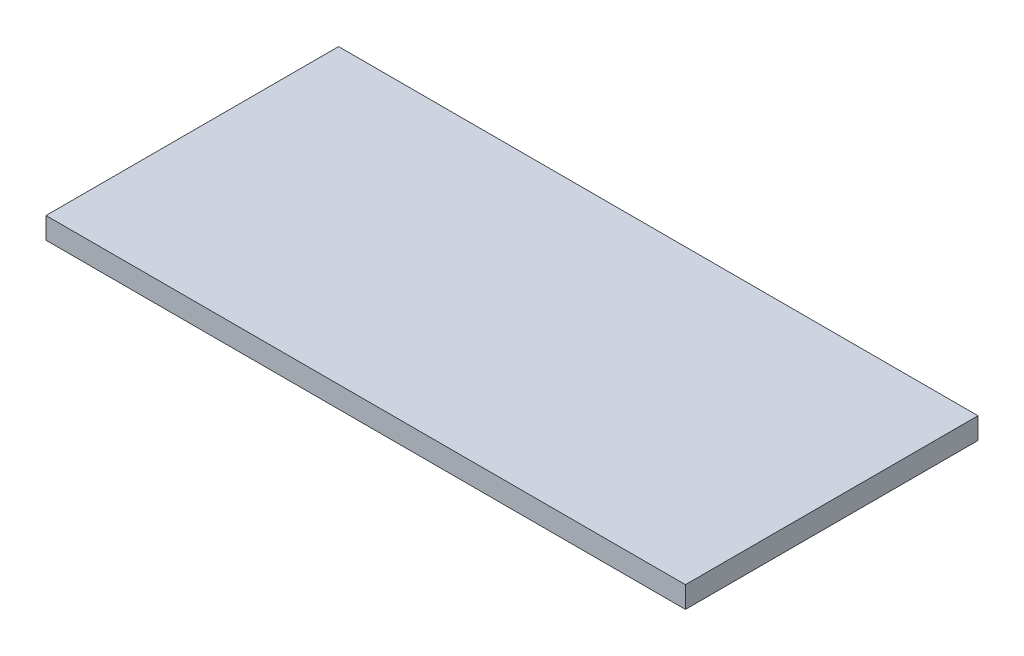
ISO-10303-21;
HEADER;
FILE_DESCRIPTION(('STEP AP214'),'2;1');
FILE_NAME('part.step','',(''),(''),'','','');
FILE_SCHEMA(('AUTOMOTIVE_DESIGN { 1 0 10303 214 1 1 1 1 }'));
ENDSEC;
DATA;
#1=APPLICATION_CONTEXT('core data for automotive mechanical design processes');
#2=APPLICATION_PROTOCOL_DEFINITION('international standard','automotive_design',2000,#1);
#3=PRODUCT_CONTEXT('',#1,'mechanical');
#4=PRODUCT('Part','Part','',(#3));
#5=PRODUCT_RELATED_PRODUCT_CATEGORY('part','',(#4));
#6=PRODUCT_DEFINITION_FORMATION('','',#4);
#7=PRODUCT_DEFINITION_CONTEXT('part definition',#1,'design');
#8=PRODUCT_DEFINITION('design','',#6,#7);
#9=PRODUCT_DEFINITION_SHAPE('','',#8);
#10=(LENGTH_UNIT() NAMED_UNIT(*) SI_UNIT(.MILLI.,.METRE.));
#11=(NAMED_UNIT(*) PLANE_ANGLE_UNIT() SI_UNIT($,.RADIAN.));
#12=(NAMED_UNIT(*) SI_UNIT($,.STERADIAN.) SOLID_ANGLE_UNIT());
#13=UNCERTAINTY_MEASURE_WITH_UNIT(LENGTH_MEASURE(1.E-05),#10,'distance_accuracy_value','');
#14=(GEOMETRIC_REPRESENTATION_CONTEXT(3) GLOBAL_UNCERTAINTY_ASSIGNED_CONTEXT((#13)) GLOBAL_UNIT_ASSIGNED_CONTEXT((#10,
#11,#12)) REPRESENTATION_CONTEXT('',''));
#15=CARTESIAN_POINT('',(0.,0.,0.));
#16=DIRECTION('',(0.,0.,1.));
#17=DIRECTION('',(1.,0.,0.));
#18=AXIS2_PLACEMENT_3D('',#15,#16,#17);
#19=CARTESIAN_POINT('',(152.,5.1,-69.55));
#20=DIRECTION('',(-1.,0.,0.));
#21=DIRECTION('',(0.,0.,1.));
#22=AXIS2_PLACEMENT_3D('',#19,#20,#21);
#23=PLANE('',#22);
#24=DIRECTION('',(0.,0.,-1.));
#25=VECTOR('',#24,1.);
#26=CARTESIAN_POINT('',(152.,-5.1,-69.55));
#27=LINE('',#26,#25);
#28=CARTESIAN_POINT('',(152.,-5.1,69.55));
#29=VERTEX_POINT('',#28);
#30=CARTESIAN_POINT('',(152.,-5.1,-69.55));
#31=VERTEX_POINT('',#30);
#32=EDGE_CURVE('E95',#29,#31,#27,.T.);
#33=ORIENTED_EDGE('',*,*,#32,.T.);
#34=DIRECTION('',(0.,-1.,0.));
#35=VECTOR('',#34,1.);
#36=CARTESIAN_POINT('',(152.,5.1,-69.55));
#37=LINE('',#36,#35);
#38=CARTESIAN_POINT('',(152.,5.1,-69.55));
#39=VERTEX_POINT('',#38);
#40=EDGE_CURVE('E11',#39,#31,#37,.T.);
#41=ORIENTED_EDGE('',*,*,#40,.F.);
#42=DIRECTION('',(0.,0.,-1.));
#43=VECTOR('',#42,1.);
#44=CARTESIAN_POINT('',(152.,5.1,-69.55));
#45=LINE('',#44,#43);
#46=CARTESIAN_POINT('',(152.,5.1,69.55));
#47=VERTEX_POINT('',#46);
#48=EDGE_CURVE('E83',#47,#39,#45,.T.);
#49=ORIENTED_EDGE('',*,*,#48,.F.);
#50=DIRECTION('',(0.,-1.,0.));
#51=VECTOR('',#50,1.);
#52=CARTESIAN_POINT('',(152.,5.1,69.55));
#53=LINE('',#52,#51);
#54=EDGE_CURVE('E91',#47,#29,#53,.T.);
#55=ORIENTED_EDGE('',*,*,#54,.T.);
#56=EDGE_LOOP('',(#33,#41,#49,#55));
#57=FACE_BOUND('',#56,.T.);
#58=ADVANCED_FACE('F32',(#57),#23,.F.);
#59=CARTESIAN_POINT('',(-152.,5.1,-69.55));
#60=DIRECTION('',(0.,0.,1.));
#61=DIRECTION('',(1.,0.,0.));
#62=AXIS2_PLACEMENT_3D('',#59,#60,#61);
#63=PLANE('',#62);
#64=DIRECTION('',(-1.,0.,0.));
#65=VECTOR('',#64,1.);
#66=CARTESIAN_POINT('',(-152.,-5.1,-69.55));
#67=LINE('',#66,#65);
#68=CARTESIAN_POINT('',(-152.,-5.1,-69.55));
#69=VERTEX_POINT('',#68);
#70=EDGE_CURVE('E87',#31,#69,#67,.T.);
#71=ORIENTED_EDGE('',*,*,#70,.T.);
#72=DIRECTION('',(0.,-1.,0.));
#73=VECTOR('',#72,1.);
#74=CARTESIAN_POINT('',(-152.,5.1,-69.55));
#75=LINE('',#74,#73);
#76=CARTESIAN_POINT('',(-152.,5.1,-69.55));
#77=VERTEX_POINT('',#76);
#78=EDGE_CURVE('E40',#77,#69,#75,.T.);
#79=ORIENTED_EDGE('',*,*,#78,.F.);
#80=DIRECTION('',(-1.,0.,0.));
#81=VECTOR('',#80,1.);
#82=CARTESIAN_POINT('',(-152.,5.1,-69.55));
#83=LINE('',#82,#81);
#84=EDGE_CURVE('E78',#39,#77,#83,.T.);
#85=ORIENTED_EDGE('',*,*,#84,.F.);
#86=ORIENTED_EDGE('',*,*,#40,.T.);
#87=EDGE_LOOP('',(#71,#79,#85,#86));
#88=FACE_BOUND('',#87,.T.);
#89=ADVANCED_FACE('F86',(#88),#63,.F.);
#90=CARTESIAN_POINT('',(-152.,5.1,-69.55));
#91=DIRECTION('',(1.,0.,0.));
#92=DIRECTION('',(0.,0.,-1.));
#93=AXIS2_PLACEMENT_3D('',#90,#91,#92);
#94=PLANE('',#93);
#95=DIRECTION('',(0.,0.,1.));
#96=VECTOR('',#95,1.);
#97=CARTESIAN_POINT('',(-152.,-5.1,-69.55));
#98=LINE('',#97,#96);
#99=CARTESIAN_POINT('',(-152.,-5.1,69.55));
#100=VERTEX_POINT('',#99);
#101=EDGE_CURVE('E65',#69,#100,#98,.T.);
#102=ORIENTED_EDGE('',*,*,#101,.T.);
#103=DIRECTION('',(0.,-1.,0.));
#104=VECTOR('',#103,1.);
#105=CARTESIAN_POINT('',(-152.,5.1,69.55));
#106=LINE('',#105,#104);
#107=CARTESIAN_POINT('',(-152.,5.1,69.55));
#108=VERTEX_POINT('',#107);
#109=EDGE_CURVE('E88',#108,#100,#106,.T.);
#110=ORIENTED_EDGE('',*,*,#109,.F.);
#111=DIRECTION('',(0.,0.,1.));
#112=VECTOR('',#111,1.);
#113=CARTESIAN_POINT('',(-152.,5.1,-69.55));
#114=LINE('',#113,#112);
#115=EDGE_CURVE('E81',#77,#108,#114,.T.);
#116=ORIENTED_EDGE('',*,*,#115,.F.);
#117=ORIENTED_EDGE('',*,*,#78,.T.);
#118=EDGE_LOOP('',(#102,#110,#116,#117));
#119=FACE_BOUND('',#118,.T.);
#120=ADVANCED_FACE('F89',(#119),#94,.F.);
#121=CARTESIAN_POINT('',(-152.,5.1,69.55));
#122=DIRECTION('',(0.,0.,-1.));
#123=DIRECTION('',(-1.,0.,0.));
#124=AXIS2_PLACEMENT_3D('',#121,#122,#123);
#125=PLANE('',#124);
#126=DIRECTION('',(1.,0.,0.));
#127=VECTOR('',#126,1.);
#128=CARTESIAN_POINT('',(-152.,-5.1,69.55));
#129=LINE('',#128,#127);
#130=EDGE_CURVE('E71',#100,#29,#129,.T.);
#131=ORIENTED_EDGE('',*,*,#130,.T.);
#132=ORIENTED_EDGE('',*,*,#54,.F.);
#133=DIRECTION('',(1.,0.,0.));
#134=VECTOR('',#133,1.);
#135=CARTESIAN_POINT('',(-152.,5.1,69.55));
#136=LINE('',#135,#134);
#137=EDGE_CURVE('E48',#108,#47,#136,.T.);
#138=ORIENTED_EDGE('',*,*,#137,.F.);
#139=ORIENTED_EDGE('',*,*,#109,.T.);
#140=EDGE_LOOP('',(#131,#132,#138,#139));
#141=FACE_BOUND('',#140,.T.);
#142=ADVANCED_FACE('F102',(#141),#125,.F.);
#143=CARTESIAN_POINT('',(0.,5.1,0.));
#144=DIRECTION('',(0.,1.,0.));
#145=DIRECTION('',(0.,0.,1.));
#146=AXIS2_PLACEMENT_3D('',#143,#144,#145);
#147=PLANE('',#146);
#148=ORIENTED_EDGE('',*,*,#48,.T.);
#149=ORIENTED_EDGE('',*,*,#84,.T.);
#150=ORIENTED_EDGE('',*,*,#115,.T.);
#151=ORIENTED_EDGE('',*,*,#137,.T.);
#152=EDGE_LOOP('',(#148,#149,#150,#151));
#153=FACE_BOUND('',#152,.T.);
#154=ADVANCED_FACE('F79',(#153),#147,.T.);
#155=CARTESIAN_POINT('',(0.,-5.1,0.));
#156=DIRECTION('',(0.,1.,0.));
#157=DIRECTION('',(0.,0.,1.));
#158=AXIS2_PLACEMENT_3D('',#155,#156,#157);
#159=PLANE('',#158);
#160=ORIENTED_EDGE('',*,*,#32,.F.);
#161=ORIENTED_EDGE('',*,*,#130,.F.);
#162=ORIENTED_EDGE('',*,*,#101,.F.);
#163=ORIENTED_EDGE('',*,*,#70,.F.);
#164=EDGE_LOOP('',(#160,#161,#162,#163));
#165=FACE_BOUND('',#164,.T.);
#166=ADVANCED_FACE('F105',(#165),#159,.F.);
#167=CLOSED_SHELL('',(#58,#89,#120,#142,#154,#166));
#168=MANIFOLD_SOLID_BREP('B2',#167);
#169=ADVANCED_BREP_SHAPE_REPRESENTATION('',(#18,#168),#14);
#170=SHAPE_DEFINITION_REPRESENTATION(#9,#169);
ENDSEC;
END-ISO-10303-21;
